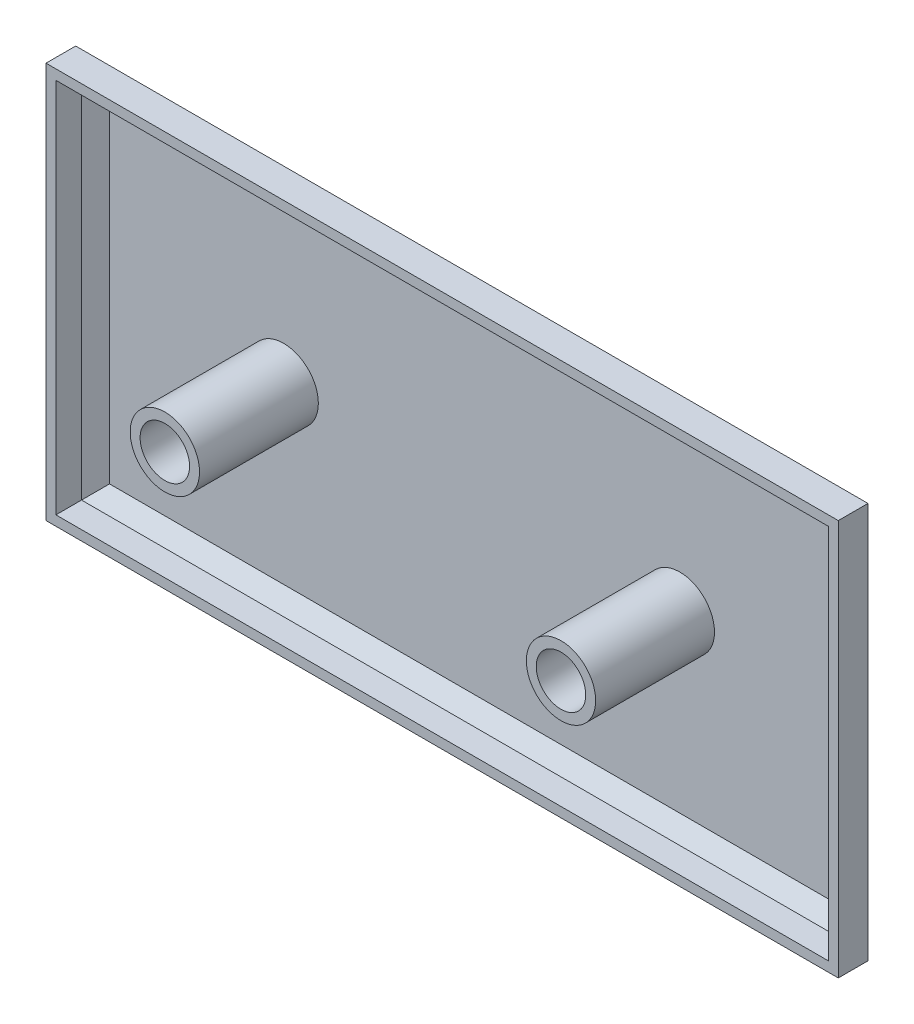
ISO-10303-21;
HEADER;
FILE_DESCRIPTION(('STEP AP214'),'2;1');
FILE_NAME('part.step','',(''),(''),'','','');
FILE_SCHEMA(('AUTOMOTIVE_DESIGN { 1 0 10303 214 1 1 1 1 }'));
ENDSEC;
DATA;
#1=APPLICATION_CONTEXT('core data for automotive mechanical design processes');
#2=APPLICATION_PROTOCOL_DEFINITION('international standard','automotive_design',2000,#1);
#3=PRODUCT_CONTEXT('',#1,'mechanical');
#4=PRODUCT('Part','Part','',(#3));
#5=PRODUCT_RELATED_PRODUCT_CATEGORY('part','',(#4));
#6=PRODUCT_DEFINITION_FORMATION('','',#4);
#7=PRODUCT_DEFINITION_CONTEXT('part definition',#1,'design');
#8=PRODUCT_DEFINITION('design','',#6,#7);
#9=PRODUCT_DEFINITION_SHAPE('','',#8);
#10=(LENGTH_UNIT() NAMED_UNIT(*) SI_UNIT(.MILLI.,.METRE.));
#11=(NAMED_UNIT(*) PLANE_ANGLE_UNIT() SI_UNIT($,.RADIAN.));
#12=(NAMED_UNIT(*) SI_UNIT($,.STERADIAN.) SOLID_ANGLE_UNIT());
#13=UNCERTAINTY_MEASURE_WITH_UNIT(LENGTH_MEASURE(1.E-05),#10,'distance_accuracy_value','');
#14=(GEOMETRIC_REPRESENTATION_CONTEXT(3) GLOBAL_UNCERTAINTY_ASSIGNED_CONTEXT((#13)) GLOBAL_UNIT_ASSIGNED_CONTEXT((#10,
#11,#12)) REPRESENTATION_CONTEXT('',''));
#15=CARTESIAN_POINT('',(0.,0.,0.));
#16=DIRECTION('',(0.,0.,1.));
#17=DIRECTION('',(1.,0.,0.));
#18=AXIS2_PLACEMENT_3D('',#15,#16,#17);
#19=CARTESIAN_POINT('',(0.,0.,-1.5));
#20=DIRECTION('',(0.,0.,1.));
#21=DIRECTION('',(1.,0.,0.));
#22=AXIS2_PLACEMENT_3D('',#19,#20,#21);
#23=PLANE('',#22);
#24=DIRECTION('',(1.,0.,0.));
#25=VECTOR('',#24,1.);
#26=CARTESIAN_POINT('',(-40.,-17.5857864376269,-1.5));
#27=LINE('',#26,#25);
#28=CARTESIAN_POINT('',(37.5857864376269,-17.5857864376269,-1.5));
#29=VERTEX_POINT('',#28);
#30=CARTESIAN_POINT('',(-37.5857864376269,-17.5857864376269,-1.5));
#31=VERTEX_POINT('',#30);
#32=EDGE_CURVE('E168',#29,#31,#27,.F.);
#33=ORIENTED_EDGE('',*,*,#32,.F.);
#34=DIRECTION('',(0.,1.,0.));
#35=VECTOR('',#34,1.);
#36=CARTESIAN_POINT('',(37.5857864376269,20.,-1.5));
#37=LINE('',#36,#35);
#38=CARTESIAN_POINT('',(37.5857864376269,17.5857864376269,-1.5));
#39=VERTEX_POINT('',#38);
#40=EDGE_CURVE('E157',#39,#29,#37,.F.);
#41=ORIENTED_EDGE('',*,*,#40,.F.);
#42=DIRECTION('',(-1.,0.,0.));
#43=VECTOR('',#42,1.);
#44=CARTESIAN_POINT('',(-40.,17.5857864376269,-1.5));
#45=LINE('',#44,#43);
#46=CARTESIAN_POINT('',(-37.5857864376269,17.5857864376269,-1.5));
#47=VERTEX_POINT('',#46);
#48=EDGE_CURVE('E167',#47,#39,#45,.F.);
#49=ORIENTED_EDGE('',*,*,#48,.F.);
#50=DIRECTION('',(0.,-1.,0.));
#51=VECTOR('',#50,1.);
#52=CARTESIAN_POINT('',(-37.5857864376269,20.,-1.5));
#53=LINE('',#52,#51);
#54=EDGE_CURVE('E172',#31,#47,#53,.F.);
#55=ORIENTED_EDGE('',*,*,#54,.F.);
#56=EDGE_LOOP('',(#33,#41,#49,#55));
#57=FACE_BOUND('',#56,.T.);
#58=CARTESIAN_POINT('',(-20.,0.,-1.5));
#59=DIRECTION('',(0.,0.,1.));
#60=DIRECTION('',(1.,0.,0.));
#61=AXIS2_PLACEMENT_3D('',#58,#59,#60);
#62=CIRCLE('',#61,3.5);
#63=CARTESIAN_POINT('',(-16.5,0.,-1.5));
#64=VERTEX_POINT('',#63);
#65=EDGE_CURVE('E518',#64,#64,#62,.T.);
#66=ORIENTED_EDGE('',*,*,#65,.F.);
#67=EDGE_LOOP('',(#66));
#68=FACE_BOUND('',#67,.T.);
#69=CARTESIAN_POINT('',(20.,0.,-1.5));
#70=DIRECTION('',(0.,0.,1.));
#71=DIRECTION('',(1.,0.,0.));
#72=AXIS2_PLACEMENT_3D('',#69,#70,#71);
#73=CIRCLE('',#72,3.5);
#74=CARTESIAN_POINT('',(23.5,0.,-1.5));
#75=VERTEX_POINT('',#74);
#76=EDGE_CURVE('E527',#75,#75,#73,.T.);
#77=ORIENTED_EDGE('',*,*,#76,.F.);
#78=EDGE_LOOP('',(#77));
#79=FACE_BOUND('',#78,.T.);
#80=ADVANCED_FACE('F33',(#57,#68,#79),#23,.T.);
#81=CARTESIAN_POINT('',(-40.,20.,2.5));
#82=DIRECTION('',(1.,0.,0.));
#83=DIRECTION('',(0.,1.,0.));
#84=AXIS2_PLACEMENT_3D('',#81,#82,#83);
#85=PLANE('',#84);
#86=DIRECTION('',(0.,0.,-1.));
#87=VECTOR('',#86,1.);
#88=CARTESIAN_POINT('',(-40.,20.,2.5));
#89=LINE('',#88,#87);
#90=CARTESIAN_POINT('',(-40.,20.,2.5));
#91=VERTEX_POINT('',#90);
#92=CARTESIAN_POINT('',(-40.,20.,-0.499999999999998));
#93=VERTEX_POINT('',#92);
#94=EDGE_CURVE('E195',#91,#93,#89,.T.);
#95=ORIENTED_EDGE('',*,*,#94,.T.);
#96=DIRECTION('',(0.,-1.,0.));
#97=VECTOR('',#96,1.);
#98=CARTESIAN_POINT('',(-40.,20.,-0.499999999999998));
#99=LINE('',#98,#97);
#100=CARTESIAN_POINT('',(-40.,-20.,-0.499999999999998));
#101=VERTEX_POINT('',#100);
#102=EDGE_CURVE('E205',#93,#101,#99,.T.);
#103=ORIENTED_EDGE('',*,*,#102,.T.);
#104=DIRECTION('',(0.,0.,-1.));
#105=VECTOR('',#104,1.);
#106=CARTESIAN_POINT('',(-40.,-20.,2.5));
#107=LINE('',#106,#105);
#108=CARTESIAN_POINT('',(-40.,-20.,2.5));
#109=VERTEX_POINT('',#108);
#110=EDGE_CURVE('E203',#109,#101,#107,.T.);
#111=ORIENTED_EDGE('',*,*,#110,.F.);
#112=DIRECTION('',(0.,-1.,0.));
#113=VECTOR('',#112,1.);
#114=CARTESIAN_POINT('',(-40.,20.,2.5));
#115=LINE('',#114,#113);
#116=EDGE_CURVE('E185',#91,#109,#115,.T.);
#117=ORIENTED_EDGE('',*,*,#116,.F.);
#118=EDGE_LOOP('',(#95,#103,#111,#117));
#119=FACE_BOUND('',#118,.T.);
#120=ADVANCED_FACE('F252',(#119),#85,.F.);
#121=CARTESIAN_POINT('',(-40.,-20.,2.5));
#122=DIRECTION('',(0.,1.,0.));
#123=DIRECTION('',(0.,0.,1.));
#124=AXIS2_PLACEMENT_3D('',#121,#122,#123);
#125=PLANE('',#124);
#126=ORIENTED_EDGE('',*,*,#110,.T.);
#127=DIRECTION('',(1.,0.,0.));
#128=VECTOR('',#127,1.);
#129=CARTESIAN_POINT('',(-40.,-20.,-0.499999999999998));
#130=LINE('',#129,#128);
#131=CARTESIAN_POINT('',(40.,-20.,-0.499999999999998));
#132=VERTEX_POINT('',#131);
#133=EDGE_CURVE('E56',#101,#132,#130,.T.);
#134=ORIENTED_EDGE('',*,*,#133,.T.);
#135=DIRECTION('',(0.,0.,-1.));
#136=VECTOR('',#135,1.);
#137=CARTESIAN_POINT('',(40.,-20.,2.5));
#138=LINE('',#137,#136);
#139=CARTESIAN_POINT('',(40.,-20.,2.5));
#140=VERTEX_POINT('',#139);
#141=EDGE_CURVE('E201',#140,#132,#138,.T.);
#142=ORIENTED_EDGE('',*,*,#141,.F.);
#143=DIRECTION('',(1.,0.,0.));
#144=VECTOR('',#143,1.);
#145=CARTESIAN_POINT('',(-40.,-20.,2.5));
#146=LINE('',#145,#144);
#147=EDGE_CURVE('E188',#109,#140,#146,.T.);
#148=ORIENTED_EDGE('',*,*,#147,.F.);
#149=EDGE_LOOP('',(#126,#134,#142,#148));
#150=FACE_BOUND('',#149,.T.);
#151=ADVANCED_FACE('F319',(#150),#125,.F.);
#152=CARTESIAN_POINT('',(40.,20.,2.5));
#153=DIRECTION('',(-1.,0.,0.));
#154=DIRECTION('',(0.,0.,1.));
#155=AXIS2_PLACEMENT_3D('',#152,#153,#154);
#156=PLANE('',#155);
#157=ORIENTED_EDGE('',*,*,#141,.T.);
#158=DIRECTION('',(0.,1.,0.));
#159=VECTOR('',#158,1.);
#160=CARTESIAN_POINT('',(40.,20.,-0.499999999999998));
#161=LINE('',#160,#159);
#162=CARTESIAN_POINT('',(40.,20.,-0.499999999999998));
#163=VERTEX_POINT('',#162);
#164=EDGE_CURVE('E219',#132,#163,#161,.T.);
#165=ORIENTED_EDGE('',*,*,#164,.T.);
#166=DIRECTION('',(0.,0.,-1.));
#167=VECTOR('',#166,1.);
#168=CARTESIAN_POINT('',(40.,20.,2.5));
#169=LINE('',#168,#167);
#170=CARTESIAN_POINT('',(40.,20.,2.5));
#171=VERTEX_POINT('',#170);
#172=EDGE_CURVE('E198',#171,#163,#169,.T.);
#173=ORIENTED_EDGE('',*,*,#172,.F.);
#174=DIRECTION('',(0.,1.,0.));
#175=VECTOR('',#174,1.);
#176=CARTESIAN_POINT('',(40.,20.,2.5));
#177=LINE('',#176,#175);
#178=EDGE_CURVE('E191',#140,#171,#177,.T.);
#179=ORIENTED_EDGE('',*,*,#178,.F.);
#180=EDGE_LOOP('',(#157,#165,#173,#179));
#181=FACE_BOUND('',#180,.T.);
#182=ADVANCED_FACE('F315',(#181),#156,.F.);
#183=CARTESIAN_POINT('',(-40.,20.,2.5));
#184=DIRECTION('',(0.,-1.,0.));
#185=DIRECTION('',(1.,0.,0.));
#186=AXIS2_PLACEMENT_3D('',#183,#184,#185);
#187=PLANE('',#186);
#188=ORIENTED_EDGE('',*,*,#172,.T.);
#189=DIRECTION('',(-1.,0.,0.));
#190=VECTOR('',#189,1.);
#191=CARTESIAN_POINT('',(-40.,20.,-0.499999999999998));
#192=LINE('',#191,#190);
#193=EDGE_CURVE('E217',#163,#93,#192,.T.);
#194=ORIENTED_EDGE('',*,*,#193,.T.);
#195=ORIENTED_EDGE('',*,*,#94,.F.);
#196=DIRECTION('',(-1.,0.,0.));
#197=VECTOR('',#196,1.);
#198=CARTESIAN_POINT('',(-40.,20.,2.5));
#199=LINE('',#198,#197);
#200=EDGE_CURVE('E193',#171,#91,#199,.T.);
#201=ORIENTED_EDGE('',*,*,#200,.F.);
#202=EDGE_LOOP('',(#188,#194,#195,#201));
#203=FACE_BOUND('',#202,.T.);
#204=ADVANCED_FACE('F308',(#203),#187,.F.);
#205=CARTESIAN_POINT('',(0.,0.,2.5));
#206=DIRECTION('',(0.,0.,1.));
#207=DIRECTION('',(1.,0.,0.));
#208=AXIS2_PLACEMENT_3D('',#205,#206,#207);
#209=PLANE('',#208);
#210=DIRECTION('',(0.,-1.,0.));
#211=VECTOR('',#210,1.);
#212=CARTESIAN_POINT('',(-39.,20.,2.5));
#213=LINE('',#212,#211);
#214=CARTESIAN_POINT('',(-39.,19.,2.5));
#215=VERTEX_POINT('',#214);
#216=CARTESIAN_POINT('',(-39.,-19.,2.5));
#217=VERTEX_POINT('',#216);
#218=EDGE_CURVE('E161',#215,#217,#213,.T.);
#219=ORIENTED_EDGE('',*,*,#218,.F.);
#220=DIRECTION('',(-1.,0.,0.));
#221=VECTOR('',#220,1.);
#222=CARTESIAN_POINT('',(-40.,19.,2.5));
#223=LINE('',#222,#221);
#224=CARTESIAN_POINT('',(39.,19.,2.5));
#225=VERTEX_POINT('',#224);
#226=EDGE_CURVE('E182',#225,#215,#223,.T.);
#227=ORIENTED_EDGE('',*,*,#226,.F.);
#228=DIRECTION('',(0.,1.,0.));
#229=VECTOR('',#228,1.);
#230=CARTESIAN_POINT('',(39.,20.,2.5));
#231=LINE('',#230,#229);
#232=CARTESIAN_POINT('',(39.,-19.,2.5));
#233=VERTEX_POINT('',#232);
#234=EDGE_CURVE('E180',#233,#225,#231,.T.);
#235=ORIENTED_EDGE('',*,*,#234,.F.);
#236=DIRECTION('',(1.,0.,0.));
#237=VECTOR('',#236,1.);
#238=CARTESIAN_POINT('',(-40.,-19.,2.5));
#239=LINE('',#238,#237);
#240=EDGE_CURVE('E144',#217,#233,#239,.T.);
#241=ORIENTED_EDGE('',*,*,#240,.F.);
#242=EDGE_LOOP('',(#219,#227,#235,#241));
#243=FACE_BOUND('',#242,.T.);
#244=ORIENTED_EDGE('',*,*,#116,.T.);
#245=ORIENTED_EDGE('',*,*,#147,.T.);
#246=ORIENTED_EDGE('',*,*,#178,.T.);
#247=ORIENTED_EDGE('',*,*,#200,.T.);
#248=EDGE_LOOP('',(#244,#245,#246,#247));
#249=FACE_BOUND('',#248,.T.);
#250=ADVANCED_FACE('F304',(#243,#249),#209,.T.);
#251=CARTESIAN_POINT('',(0.,0.,-2.5));
#252=DIRECTION('',(0.,0.,1.));
#253=DIRECTION('',(1.,0.,0.));
#254=AXIS2_PLACEMENT_3D('',#251,#252,#253);
#255=PLANE('',#254);
#256=DIRECTION('',(-1.,0.,0.));
#257=VECTOR('',#256,1.);
#258=CARTESIAN_POINT('',(0.,-18.,-2.5));
#259=LINE('',#258,#257);
#260=CARTESIAN_POINT('',(38.,-18.,-2.5));
#261=VERTEX_POINT('',#260);
#262=CARTESIAN_POINT('',(-38.,-18.,-2.5));
#263=VERTEX_POINT('',#262);
#264=EDGE_CURVE('E208',#261,#263,#259,.T.);
#265=ORIENTED_EDGE('',*,*,#264,.T.);
#266=DIRECTION('',(0.,1.,0.));
#267=VECTOR('',#266,1.);
#268=CARTESIAN_POINT('',(-38.,0.,-2.5));
#269=LINE('',#268,#267);
#270=CARTESIAN_POINT('',(-38.,18.,-2.5));
#271=VERTEX_POINT('',#270);
#272=EDGE_CURVE('E214',#263,#271,#269,.T.);
#273=ORIENTED_EDGE('',*,*,#272,.T.);
#274=DIRECTION('',(1.,0.,0.));
#275=VECTOR('',#274,1.);
#276=CARTESIAN_POINT('',(0.,18.,-2.5));
#277=LINE('',#276,#275);
#278=CARTESIAN_POINT('',(38.,18.,-2.5));
#279=VERTEX_POINT('',#278);
#280=EDGE_CURVE('E212',#271,#279,#277,.T.);
#281=ORIENTED_EDGE('',*,*,#280,.T.);
#282=DIRECTION('',(0.,-1.,0.));
#283=VECTOR('',#282,1.);
#284=CARTESIAN_POINT('',(38.,0.,-2.5));
#285=LINE('',#284,#283);
#286=EDGE_CURVE('E210',#279,#261,#285,.T.);
#287=ORIENTED_EDGE('',*,*,#286,.T.);
#288=EDGE_LOOP('',(#265,#273,#281,#287));
#289=FACE_BOUND('',#288,.T.);
#290=ADVANCED_FACE('F307',(#289),#255,.F.);
#291=CARTESIAN_POINT('',(40.,20.,-0.499999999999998));
#292=DIRECTION('',(-0.707106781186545,0.,0.70710678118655));
#293=DIRECTION('',(0.,1.,0.));
#294=AXIS2_PLACEMENT_3D('',#291,#292,#293);
#295=PLANE('',#294);
#296=DIRECTION('',(0.577350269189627,-0.577350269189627,0.577350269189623));
#297=VECTOR('',#296,1.);
#298=CARTESIAN_POINT('',(13.3333333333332,6.66666666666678,-27.1666666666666));
#299=LINE('',#298,#297);
#300=EDGE_CURVE('E225',#261,#132,#299,.T.);
#301=ORIENTED_EDGE('',*,*,#300,.F.);
#302=ORIENTED_EDGE('',*,*,#286,.F.);
#303=DIRECTION('',(0.577350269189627,0.577350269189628,0.577350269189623));
#304=VECTOR('',#303,1.);
#305=CARTESIAN_POINT('',(40.,20.,-0.499999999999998));
#306=LINE('',#305,#304);
#307=EDGE_CURVE('E189',#163,#279,#306,.F.);
#308=ORIENTED_EDGE('',*,*,#307,.F.);
#309=ORIENTED_EDGE('',*,*,#164,.F.);
#310=EDGE_LOOP('',(#301,#302,#308,#309));
#311=FACE_BOUND('',#310,.T.);
#312=ADVANCED_FACE('F35',(#311),#295,.F.);
#313=CARTESIAN_POINT('',(-40.,20.,-0.499999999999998));
#314=DIRECTION('',(0.,-0.707106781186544,0.707106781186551));
#315=DIRECTION('',(-1.,0.,0.));
#316=AXIS2_PLACEMENT_3D('',#313,#314,#315);
#317=PLANE('',#316);
#318=ORIENTED_EDGE('',*,*,#307,.T.);
#319=ORIENTED_EDGE('',*,*,#280,.F.);
#320=DIRECTION('',(-0.577350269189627,0.577350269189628,0.577350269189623));
#321=VECTOR('',#320,1.);
#322=CARTESIAN_POINT('',(-40.,20.,-0.499999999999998));
#323=LINE('',#322,#321);
#324=EDGE_CURVE('E223',#93,#271,#323,.F.);
#325=ORIENTED_EDGE('',*,*,#324,.F.);
#326=ORIENTED_EDGE('',*,*,#193,.F.);
#327=EDGE_LOOP('',(#318,#319,#325,#326));
#328=FACE_BOUND('',#327,.T.);
#329=ADVANCED_FACE('F331',(#328),#317,.F.);
#330=CARTESIAN_POINT('',(-40.,-20.,-0.499999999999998));
#331=DIRECTION('',(0.,0.707106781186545,0.70710678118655));
#332=DIRECTION('',(1.,0.,0.));
#333=AXIS2_PLACEMENT_3D('',#330,#331,#332);
#334=PLANE('',#333);
#335=ORIENTED_EDGE('',*,*,#300,.T.);
#336=ORIENTED_EDGE('',*,*,#133,.F.);
#337=DIRECTION('',(0.577350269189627,0.577350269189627,-0.577350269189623));
#338=VECTOR('',#337,1.);
#339=CARTESIAN_POINT('',(-40.,-20.,-0.499999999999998));
#340=LINE('',#339,#338);
#341=EDGE_CURVE('E136',#263,#101,#340,.F.);
#342=ORIENTED_EDGE('',*,*,#341,.F.);
#343=ORIENTED_EDGE('',*,*,#264,.F.);
#344=EDGE_LOOP('',(#335,#336,#342,#343));
#345=FACE_BOUND('',#344,.T.);
#346=ADVANCED_FACE('F328',(#345),#334,.F.);
#347=CARTESIAN_POINT('',(-40.,20.,-0.499999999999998));
#348=DIRECTION('',(0.707106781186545,0.,0.70710678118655));
#349=DIRECTION('',(0.,-1.,0.));
#350=AXIS2_PLACEMENT_3D('',#347,#348,#349);
#351=PLANE('',#350);
#352=ORIENTED_EDGE('',*,*,#324,.T.);
#353=ORIENTED_EDGE('',*,*,#272,.F.);
#354=ORIENTED_EDGE('',*,*,#341,.T.);
#355=ORIENTED_EDGE('',*,*,#102,.F.);
#356=EDGE_LOOP('',(#352,#353,#354,#355));
#357=FACE_BOUND('',#356,.T.);
#358=ADVANCED_FACE('F282',(#357),#351,.F.);
#359=CARTESIAN_POINT('',(-39.,20.,2.5));
#360=DIRECTION('',(1.,0.,0.));
#361=DIRECTION('',(0.,1.,0.));
#362=AXIS2_PLACEMENT_3D('',#359,#360,#361);
#363=PLANE('',#362);
#364=DIRECTION('',(0.,0.,-1.));
#365=VECTOR('',#364,1.);
#366=CARTESIAN_POINT('',(-39.,19.,2.5));
#367=LINE('',#366,#365);
#368=CARTESIAN_POINT('',(-39.,19.,-0.0857864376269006));
#369=VERTEX_POINT('',#368);
#370=EDGE_CURVE('E184',#215,#369,#367,.T.);
#371=ORIENTED_EDGE('',*,*,#370,.F.);
#372=ORIENTED_EDGE('',*,*,#218,.T.);
#373=DIRECTION('',(0.,0.,-1.));
#374=VECTOR('',#373,1.);
#375=CARTESIAN_POINT('',(-39.,-19.,2.5));
#376=LINE('',#375,#374);
#377=CARTESIAN_POINT('',(-39.,-19.,-0.0857864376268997));
#378=VERTEX_POINT('',#377);
#379=EDGE_CURVE('E147',#217,#378,#376,.T.);
#380=ORIENTED_EDGE('',*,*,#379,.T.);
#381=DIRECTION('',(0.,1.,0.));
#382=VECTOR('',#381,1.);
#383=CARTESIAN_POINT('',(-39.,20.,-0.0857864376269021));
#384=LINE('',#383,#382);
#385=EDGE_CURVE('E171',#369,#378,#384,.F.);
#386=ORIENTED_EDGE('',*,*,#385,.F.);
#387=EDGE_LOOP('',(#371,#372,#380,#386));
#388=FACE_BOUND('',#387,.T.);
#389=ADVANCED_FACE('F279',(#388),#363,.T.);
#390=CARTESIAN_POINT('',(-40.,-19.,2.5));
#391=DIRECTION('',(0.,1.,0.));
#392=DIRECTION('',(0.,0.,1.));
#393=AXIS2_PLACEMENT_3D('',#390,#391,#392);
#394=PLANE('',#393);
#395=ORIENTED_EDGE('',*,*,#379,.F.);
#396=ORIENTED_EDGE('',*,*,#240,.T.);
#397=DIRECTION('',(0.,0.,-1.));
#398=VECTOR('',#397,1.);
#399=CARTESIAN_POINT('',(39.,-19.,2.5));
#400=LINE('',#399,#398);
#401=CARTESIAN_POINT('',(39.,-19.,-0.0857864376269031));
#402=VERTEX_POINT('',#401);
#403=EDGE_CURVE('E140',#233,#402,#400,.T.);
#404=ORIENTED_EDGE('',*,*,#403,.T.);
#405=DIRECTION('',(-1.,0.,0.));
#406=VECTOR('',#405,1.);
#407=CARTESIAN_POINT('',(-40.,-19.,-0.0857864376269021));
#408=LINE('',#407,#406);
#409=EDGE_CURVE('E125',#378,#402,#408,.F.);
#410=ORIENTED_EDGE('',*,*,#409,.F.);
#411=EDGE_LOOP('',(#395,#396,#404,#410));
#412=FACE_BOUND('',#411,.T.);
#413=ADVANCED_FACE('F142',(#412),#394,.T.);
#414=CARTESIAN_POINT('',(39.,20.,2.5));
#415=DIRECTION('',(-1.,0.,0.));
#416=DIRECTION('',(0.,0.,1.));
#417=AXIS2_PLACEMENT_3D('',#414,#415,#416);
#418=PLANE('',#417);
#419=ORIENTED_EDGE('',*,*,#403,.F.);
#420=ORIENTED_EDGE('',*,*,#234,.T.);
#421=DIRECTION('',(0.,0.,-1.));
#422=VECTOR('',#421,1.);
#423=CARTESIAN_POINT('',(39.,19.,2.5));
#424=LINE('',#423,#422);
#425=CARTESIAN_POINT('',(39.,19.,-0.0857864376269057));
#426=VERTEX_POINT('',#425);
#427=EDGE_CURVE('E48',#225,#426,#424,.T.);
#428=ORIENTED_EDGE('',*,*,#427,.T.);
#429=DIRECTION('',(0.,-1.,0.));
#430=VECTOR('',#429,1.);
#431=CARTESIAN_POINT('',(39.,20.,-0.0857864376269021));
#432=LINE('',#431,#430);
#433=EDGE_CURVE('E137',#402,#426,#432,.F.);
#434=ORIENTED_EDGE('',*,*,#433,.F.);
#435=EDGE_LOOP('',(#419,#420,#428,#434));
#436=FACE_BOUND('',#435,.T.);
#437=ADVANCED_FACE('F149',(#436),#418,.T.);
#438=CARTESIAN_POINT('',(-40.,19.,2.5));
#439=DIRECTION('',(0.,-1.,0.));
#440=DIRECTION('',(1.,0.,0.));
#441=AXIS2_PLACEMENT_3D('',#438,#439,#440);
#442=PLANE('',#441);
#443=ORIENTED_EDGE('',*,*,#427,.F.);
#444=ORIENTED_EDGE('',*,*,#226,.T.);
#445=ORIENTED_EDGE('',*,*,#370,.T.);
#446=DIRECTION('',(1.,0.,0.));
#447=VECTOR('',#446,1.);
#448=CARTESIAN_POINT('',(-40.,19.,-0.0857864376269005));
#449=LINE('',#448,#447);
#450=EDGE_CURVE('E153',#426,#369,#449,.F.);
#451=ORIENTED_EDGE('',*,*,#450,.F.);
#452=EDGE_LOOP('',(#443,#444,#445,#451));
#453=FACE_BOUND('',#452,.T.);
#454=ADVANCED_FACE('F287',(#453),#442,.T.);
#455=CARTESIAN_POINT('',(39.2928932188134,20.,0.207106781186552));
#456=DIRECTION('',(-0.707106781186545,0.,0.70710678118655));
#457=DIRECTION('',(0.,1.,0.));
#458=AXIS2_PLACEMENT_3D('',#455,#456,#457);
#459=PLANE('',#458);
#460=DIRECTION('',(0.577350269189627,-0.577350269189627,0.577350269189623));
#461=VECTOR('',#460,1.);
#462=CARTESIAN_POINT('',(12.8619288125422,7.13807118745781,-26.2238576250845));
#463=LINE('',#462,#461);
#464=EDGE_CURVE('E129',#29,#402,#463,.T.);
#465=ORIENTED_EDGE('',*,*,#464,.T.);
#466=ORIENTED_EDGE('',*,*,#433,.T.);
#467=DIRECTION('',(-0.577350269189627,-0.577350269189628,-0.577350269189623));
#468=VECTOR('',#467,1.);
#469=CARTESIAN_POINT('',(12.8619288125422,-7.13807118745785,-26.2238576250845));
#470=LINE('',#469,#468);
#471=EDGE_CURVE('E158',#426,#39,#470,.T.);
#472=ORIENTED_EDGE('',*,*,#471,.T.);
#473=ORIENTED_EDGE('',*,*,#40,.T.);
#474=EDGE_LOOP('',(#465,#466,#472,#473));
#475=FACE_BOUND('',#474,.T.);
#476=ADVANCED_FACE('F155',(#475),#459,.T.);
#477=CARTESIAN_POINT('',(-40.,19.2928932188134,0.207106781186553));
#478=DIRECTION('',(0.,-0.707106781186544,0.707106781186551));
#479=DIRECTION('',(-1.,0.,0.));
#480=AXIS2_PLACEMENT_3D('',#477,#478,#479);
#481=PLANE('',#480);
#482=ORIENTED_EDGE('',*,*,#471,.F.);
#483=ORIENTED_EDGE('',*,*,#450,.T.);
#484=DIRECTION('',(0.577350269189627,-0.577350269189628,-0.577350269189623));
#485=VECTOR('',#484,1.);
#486=CARTESIAN_POINT('',(-39.528595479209,19.528595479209,0.442809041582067));
#487=LINE('',#486,#485);
#488=EDGE_CURVE('E159',#369,#47,#487,.T.);
#489=ORIENTED_EDGE('',*,*,#488,.T.);
#490=ORIENTED_EDGE('',*,*,#48,.T.);
#491=EDGE_LOOP('',(#482,#483,#489,#490));
#492=FACE_BOUND('',#491,.T.);
#493=ADVANCED_FACE('F292',(#492),#481,.T.);
#494=CARTESIAN_POINT('',(-40.,-19.2928932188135,0.207106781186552));
#495=DIRECTION('',(0.,0.707106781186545,0.70710678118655));
#496=DIRECTION('',(1.,0.,0.));
#497=AXIS2_PLACEMENT_3D('',#494,#495,#496);
#498=PLANE('',#497);
#499=ORIENTED_EDGE('',*,*,#464,.F.);
#500=ORIENTED_EDGE('',*,*,#32,.T.);
#501=DIRECTION('',(-0.577350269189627,-0.577350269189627,0.577350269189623));
#502=VECTOR('',#501,1.);
#503=CARTESIAN_POINT('',(-26.1952621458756,-6.19526214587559,-12.8905242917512));
#504=LINE('',#503,#502);
#505=EDGE_CURVE('E132',#31,#378,#504,.T.);
#506=ORIENTED_EDGE('',*,*,#505,.T.);
#507=ORIENTED_EDGE('',*,*,#409,.T.);
#508=EDGE_LOOP('',(#499,#500,#506,#507));
#509=FACE_BOUND('',#508,.T.);
#510=ADVANCED_FACE('F127',(#509),#498,.T.);
#511=CARTESIAN_POINT('',(-39.2928932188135,20.,0.207106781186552));
#512=DIRECTION('',(0.707106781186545,0.,0.70710678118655));
#513=DIRECTION('',(0.,-1.,0.));
#514=AXIS2_PLACEMENT_3D('',#511,#512,#513);
#515=PLANE('',#514);
#516=ORIENTED_EDGE('',*,*,#488,.F.);
#517=ORIENTED_EDGE('',*,*,#385,.T.);
#518=ORIENTED_EDGE('',*,*,#505,.F.);
#519=ORIENTED_EDGE('',*,*,#54,.T.);
#520=EDGE_LOOP('',(#516,#517,#518,#519));
#521=FACE_BOUND('',#520,.T.);
#522=ADVANCED_FACE('F274',(#521),#515,.T.);
#523=CARTESIAN_POINT('',(-20.,0.,10.5));
#524=DIRECTION('',(0.,0.,1.));
#525=DIRECTION('',(1.,0.,0.));
#526=AXIS2_PLACEMENT_3D('',#523,#524,#525);
#527=PLANE('',#526);
#528=CARTESIAN_POINT('',(-20.,0.,10.5));
#529=DIRECTION('',(0.,0.,1.));
#530=DIRECTION('',(1.,0.,0.));
#531=AXIS2_PLACEMENT_3D('',#528,#529,#530);
#532=CIRCLE('',#531,3.5);
#533=CARTESIAN_POINT('',(-16.5,0.,10.5));
#534=VERTEX_POINT('',#533);
#535=EDGE_CURVE('E177',#534,#534,#532,.T.);
#536=ORIENTED_EDGE('',*,*,#535,.T.);
#537=EDGE_LOOP('',(#536));
#538=FACE_BOUND('',#537,.T.);
#539=CARTESIAN_POINT('',(-20.,0.,10.5));
#540=DIRECTION('',(0.,0.,1.));
#541=DIRECTION('',(1.,0.,0.));
#542=AXIS2_PLACEMENT_3D('',#539,#540,#541);
#543=CIRCLE('',#542,2.5);
#544=CARTESIAN_POINT('',(-17.5,0.,10.5));
#545=VERTEX_POINT('',#544);
#546=EDGE_CURVE('E521',#545,#545,#543,.T.);
#547=ORIENTED_EDGE('',*,*,#546,.F.);
#548=EDGE_LOOP('',(#547));
#549=FACE_BOUND('',#548,.T.);
#550=ADVANCED_FACE('F271',(#538,#549),#527,.T.);
#551=CARTESIAN_POINT('',(-20.,0.,10.5));
#552=DIRECTION('',(0.,0.,-1.));
#553=DIRECTION('',(-1.,0.,0.));
#554=AXIS2_PLACEMENT_3D('',#551,#552,#553);
#555=CYLINDRICAL_SURFACE('',#554,3.5);
#556=ORIENTED_EDGE('',*,*,#535,.F.);
#557=EDGE_LOOP('',(#556));
#558=FACE_BOUND('',#557,.T.);
#559=ORIENTED_EDGE('',*,*,#65,.T.);
#560=EDGE_LOOP('',(#559));
#561=FACE_BOUND('',#560,.T.);
#562=ADVANCED_FACE('F246',(#558,#561),#555,.T.);
#563=CARTESIAN_POINT('',(-20.,0.,10.5));
#564=DIRECTION('',(0.,0.,-1.));
#565=DIRECTION('',(-1.,0.,0.));
#566=AXIS2_PLACEMENT_3D('',#563,#564,#565);
#567=CYLINDRICAL_SURFACE('',#566,2.5);
#568=ORIENTED_EDGE('',*,*,#546,.T.);
#569=EDGE_LOOP('',(#568));
#570=FACE_BOUND('',#569,.T.);
#571=CARTESIAN_POINT('',(-20.,0.,-1.5));
#572=DIRECTION('',(0.,0.,1.));
#573=DIRECTION('',(1.,0.,0.));
#574=AXIS2_PLACEMENT_3D('',#571,#572,#573);
#575=CIRCLE('',#574,2.5);
#576=CARTESIAN_POINT('',(-17.5,0.,-1.5));
#577=VERTEX_POINT('',#576);
#578=EDGE_CURVE('E41',#577,#577,#575,.F.);
#579=ORIENTED_EDGE('',*,*,#578,.T.);
#580=EDGE_LOOP('',(#579));
#581=FACE_BOUND('',#580,.T.);
#582=ADVANCED_FACE('F232',(#570,#581),#567,.F.);
#583=ORIENTED_EDGE('',*,*,#578,.F.);
#584=EDGE_LOOP('',(#583));
#585=FACE_BOUND('',#584,.T.);
#586=ADVANCED_FACE('F234',(#585),#23,.T.);
#587=CARTESIAN_POINT('',(20.,0.,10.5));
#588=DIRECTION('',(0.,0.,1.));
#589=DIRECTION('',(1.,0.,0.));
#590=AXIS2_PLACEMENT_3D('',#587,#588,#589);
#591=PLANE('',#590);
#592=CARTESIAN_POINT('',(20.,0.,10.5));
#593=DIRECTION('',(0.,0.,1.));
#594=DIRECTION('',(1.,0.,0.));
#595=AXIS2_PLACEMENT_3D('',#592,#593,#594);
#596=CIRCLE('',#595,3.5);
#597=CARTESIAN_POINT('',(23.5,0.,10.5));
#598=VERTEX_POINT('',#597);
#599=EDGE_CURVE('E526',#598,#598,#596,.T.);
#600=ORIENTED_EDGE('',*,*,#599,.T.);
#601=EDGE_LOOP('',(#600));
#602=FACE_BOUND('',#601,.T.);
#603=CARTESIAN_POINT('',(20.,0.,10.5));
#604=DIRECTION('',(0.,0.,1.));
#605=DIRECTION('',(1.,0.,0.));
#606=AXIS2_PLACEMENT_3D('',#603,#604,#605);
#607=CIRCLE('',#606,2.5);
#608=CARTESIAN_POINT('',(22.5,0.,10.5));
#609=VERTEX_POINT('',#608);
#610=EDGE_CURVE('E530',#609,#609,#607,.T.);
#611=ORIENTED_EDGE('',*,*,#610,.F.);
#612=EDGE_LOOP('',(#611));
#613=FACE_BOUND('',#612,.T.);
#614=ADVANCED_FACE('F236',(#602,#613),#591,.T.);
#615=CARTESIAN_POINT('',(20.,0.,10.5));
#616=DIRECTION('',(0.,0.,-1.));
#617=DIRECTION('',(-1.,0.,0.));
#618=AXIS2_PLACEMENT_3D('',#615,#616,#617);
#619=CYLINDRICAL_SURFACE('',#618,3.5);
#620=ORIENTED_EDGE('',*,*,#599,.F.);
#621=EDGE_LOOP('',(#620));
#622=FACE_BOUND('',#621,.T.);
#623=ORIENTED_EDGE('',*,*,#76,.T.);
#624=EDGE_LOOP('',(#623));
#625=FACE_BOUND('',#624,.T.);
#626=ADVANCED_FACE('F243',(#622,#625),#619,.T.);
#627=CARTESIAN_POINT('',(20.,0.,10.5));
#628=DIRECTION('',(0.,0.,-1.));
#629=DIRECTION('',(-1.,0.,0.));
#630=AXIS2_PLACEMENT_3D('',#627,#628,#629);
#631=CYLINDRICAL_SURFACE('',#630,2.5);
#632=ORIENTED_EDGE('',*,*,#610,.T.);
#633=EDGE_LOOP('',(#632));
#634=FACE_BOUND('',#633,.T.);
#635=CARTESIAN_POINT('',(20.,0.,-1.5));
#636=DIRECTION('',(0.,0.,1.));
#637=DIRECTION('',(1.,0.,0.));
#638=AXIS2_PLACEMENT_3D('',#635,#636,#637);
#639=CIRCLE('',#638,2.5);
#640=CARTESIAN_POINT('',(22.5,0.,-1.5));
#641=VERTEX_POINT('',#640);
#642=EDGE_CURVE('E11',#641,#641,#639,.F.);
#643=ORIENTED_EDGE('',*,*,#642,.T.);
#644=EDGE_LOOP('',(#643));
#645=FACE_BOUND('',#644,.T.);
#646=ADVANCED_FACE('F255',(#634,#645),#631,.F.);
#647=ORIENTED_EDGE('',*,*,#642,.F.);
#648=EDGE_LOOP('',(#647));
#649=FACE_BOUND('',#648,.T.);
#650=ADVANCED_FACE('F238',(#649),#23,.T.);
#651=CLOSED_SHELL('',(#80,#120,#151,#182,#204,#250,#290,#312,#329,#346,#358,#389,#413,#437,#454,
#476,#493,#510,#522,#550,#562,#582,#586,#614,#626,#646,#650));
#652=MANIFOLD_SOLID_BREP('B2',#651);
#653=ADVANCED_BREP_SHAPE_REPRESENTATION('',(#18,#652),#14);
#654=SHAPE_DEFINITION_REPRESENTATION(#9,#653);
ENDSEC;
END-ISO-10303-21;
